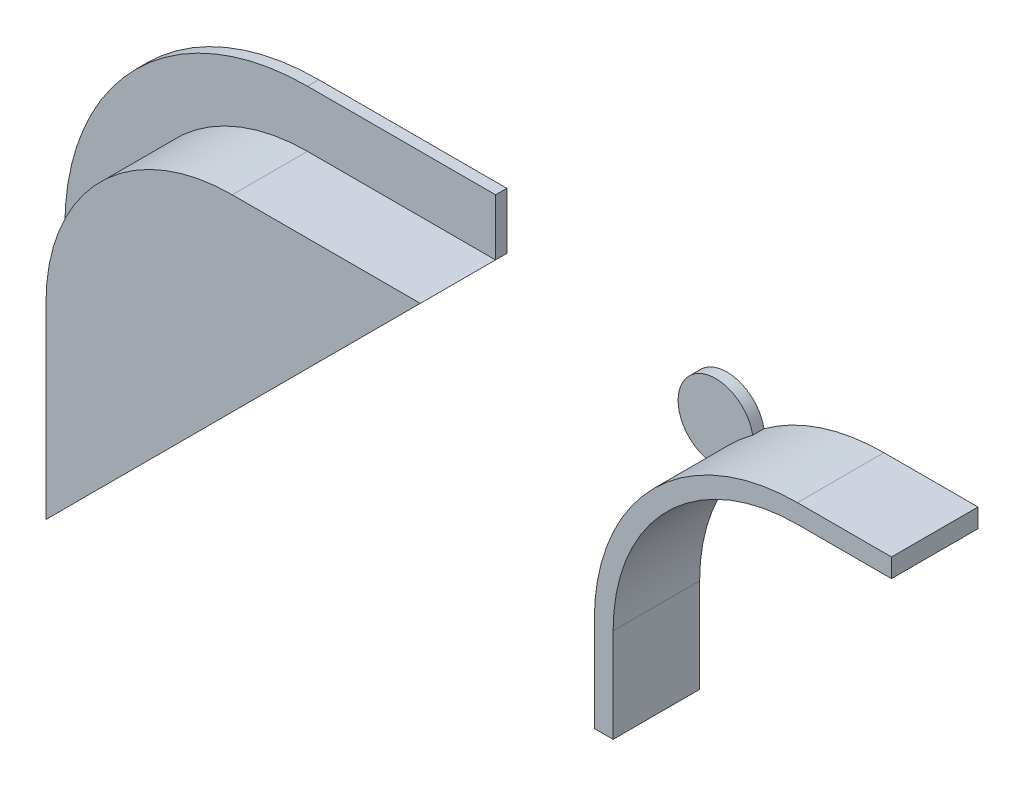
ISO-10303-21;
HEADER;
FILE_DESCRIPTION(('STEP AP214'),'2;1');
FILE_NAME('part.step','',(''),(''),'','','');
FILE_SCHEMA(('AUTOMOTIVE_DESIGN { 1 0 10303 214 1 1 1 1 }'));
ENDSEC;
DATA;
#1=APPLICATION_CONTEXT('core data for automotive mechanical design processes');
#2=APPLICATION_PROTOCOL_DEFINITION('international standard','automotive_design',2000,#1);
#3=PRODUCT_CONTEXT('',#1,'mechanical');
#4=PRODUCT('Part','Part','',(#3));
#5=PRODUCT_RELATED_PRODUCT_CATEGORY('part','',(#4));
#6=PRODUCT_DEFINITION_FORMATION('','',#4);
#7=PRODUCT_DEFINITION_CONTEXT('part definition',#1,'design');
#8=PRODUCT_DEFINITION('design','',#6,#7);
#9=PRODUCT_DEFINITION_SHAPE('','',#8);
#10=(LENGTH_UNIT() NAMED_UNIT(*) SI_UNIT(.MILLI.,.METRE.));
#11=(NAMED_UNIT(*) PLANE_ANGLE_UNIT() SI_UNIT($,.RADIAN.));
#12=(NAMED_UNIT(*) SI_UNIT($,.STERADIAN.) SOLID_ANGLE_UNIT());
#13=UNCERTAINTY_MEASURE_WITH_UNIT(LENGTH_MEASURE(1.E-05),#10,'distance_accuracy_value','');
#14=(GEOMETRIC_REPRESENTATION_CONTEXT(3) GLOBAL_UNCERTAINTY_ASSIGNED_CONTEXT((#13)) GLOBAL_UNIT_ASSIGNED_CONTEXT((#10,
#11,#12)) REPRESENTATION_CONTEXT('',''));
#15=CARTESIAN_POINT('',(0.,0.,0.));
#16=DIRECTION('',(0.,0.,1.));
#17=DIRECTION('',(1.,0.,0.));
#18=AXIS2_PLACEMENT_3D('',#15,#16,#17);
#19=CARTESIAN_POINT('',(20.2,0.,4.));
#20=DIRECTION('',(-1.,0.,0.));
#21=DIRECTION('',(0.,0.,1.));
#22=AXIS2_PLACEMENT_3D('',#19,#20,#21);
#23=PLANE('',#22);
#24=DIRECTION('',(0.,0.,-1.));
#25=VECTOR('',#24,1.);
#26=CARTESIAN_POINT('',(20.2,-5.,4.));
#27=LINE('',#26,#25);
#28=CARTESIAN_POINT('',(20.2,-5.,4.));
#29=VERTEX_POINT('',#28);
#30=CARTESIAN_POINT('',(20.2,-5.,-0.6));
#31=VERTEX_POINT('',#30);
#32=EDGE_CURVE('E136',#29,#31,#27,.T.);
#33=ORIENTED_EDGE('',*,*,#32,.T.);
#34=DIRECTION('',(0.,-1.,0.));
#35=VECTOR('',#34,1.);
#36=CARTESIAN_POINT('',(20.2,0.,-0.6));
#37=LINE('',#36,#35);
#38=CARTESIAN_POINT('',(20.2,0.,-0.6));
#39=VERTEX_POINT('',#38);
#40=EDGE_CURVE('E135',#39,#31,#37,.T.);
#41=ORIENTED_EDGE('',*,*,#40,.F.);
#42=DIRECTION('',(0.,0.,-1.));
#43=VECTOR('',#42,1.);
#44=CARTESIAN_POINT('',(20.2,0.,4.));
#45=LINE('',#44,#43);
#46=CARTESIAN_POINT('',(20.2,0.,4.));
#47=VERTEX_POINT('',#46);
#48=EDGE_CURVE('E12',#47,#39,#45,.T.);
#49=ORIENTED_EDGE('',*,*,#48,.F.);
#50=DIRECTION('',(0.,1.,0.));
#51=VECTOR('',#50,1.);
#52=CARTESIAN_POINT('',(20.2,0.,4.));
#53=LINE('',#52,#51);
#54=EDGE_CURVE('E175',#29,#47,#53,.T.);
#55=ORIENTED_EDGE('',*,*,#54,.F.);
#56=EDGE_LOOP('',(#33,#41,#49,#55));
#57=FACE_BOUND('',#56,.T.);
#58=ADVANCED_FACE('F51',(#57),#23,.F.);
#59=CARTESIAN_POINT('',(30.,0.,4.));
#60=DIRECTION('',(0.,0.,-1.));
#61=DIRECTION('',(-1.,0.,0.));
#62=AXIS2_PLACEMENT_3D('',#59,#60,#61);
#63=CYLINDRICAL_SURFACE('',#62,9.8);
#64=ORIENTED_EDGE('',*,*,#48,.T.);
#65=CARTESIAN_POINT('',(30.,0.,-0.6));
#66=DIRECTION('',(0.,0.,1.));
#67=DIRECTION('',(-1.,0.,0.));
#68=AXIS2_PLACEMENT_3D('',#65,#66,#67);
#69=CIRCLE('',#68,9.8);
#70=CARTESIAN_POINT('',(30.,9.8,-0.6));
#71=VERTEX_POINT('',#70);
#72=EDGE_CURVE('E130',#71,#39,#69,.T.);
#73=ORIENTED_EDGE('',*,*,#72,.F.);
#74=DIRECTION('',(0.,0.,-1.));
#75=VECTOR('',#74,1.);
#76=CARTESIAN_POINT('',(30.,9.8,4.));
#77=LINE('',#76,#75);
#78=CARTESIAN_POINT('',(30.,9.8,4.));
#79=VERTEX_POINT('',#78);
#80=EDGE_CURVE('E58',#79,#71,#77,.T.);
#81=ORIENTED_EDGE('',*,*,#80,.F.);
#82=CARTESIAN_POINT('',(30.,0.,4.));
#83=DIRECTION('',(0.,0.,-1.));
#84=DIRECTION('',(1.,0.,0.));
#85=AXIS2_PLACEMENT_3D('',#82,#83,#84);
#86=CIRCLE('',#85,9.8);
#87=EDGE_CURVE('E131',#47,#79,#86,.T.);
#88=ORIENTED_EDGE('',*,*,#87,.F.);
#89=EDGE_LOOP('',(#64,#73,#81,#88));
#90=FACE_BOUND('',#89,.T.);
#91=ADVANCED_FACE('F127',(#90),#63,.F.);
#92=CARTESIAN_POINT('',(30.,9.8,4.));
#93=DIRECTION('',(0.,1.,0.));
#94=DIRECTION('',(0.,0.,1.));
#95=AXIS2_PLACEMENT_3D('',#92,#93,#94);
#96=PLANE('',#95);
#97=ORIENTED_EDGE('',*,*,#80,.T.);
#98=DIRECTION('',(-1.,0.,0.));
#99=VECTOR('',#98,1.);
#100=CARTESIAN_POINT('',(35.,9.8,-0.6));
#101=LINE('',#100,#99);
#102=CARTESIAN_POINT('',(35.,9.8,-0.6));
#103=VERTEX_POINT('',#102);
#104=EDGE_CURVE('E146',#103,#71,#101,.T.);
#105=ORIENTED_EDGE('',*,*,#104,.F.);
#106=DIRECTION('',(0.,0.,-1.));
#107=VECTOR('',#106,1.);
#108=CARTESIAN_POINT('',(35.,9.8,4.));
#109=LINE('',#108,#107);
#110=CARTESIAN_POINT('',(35.,9.8,4.));
#111=VERTEX_POINT('',#110);
#112=EDGE_CURVE('E199',#111,#103,#109,.T.);
#113=ORIENTED_EDGE('',*,*,#112,.F.);
#114=DIRECTION('',(1.,0.,0.));
#115=VECTOR('',#114,1.);
#116=CARTESIAN_POINT('',(30.,9.8,4.));
#117=LINE('',#116,#115);
#118=EDGE_CURVE('E178',#79,#111,#117,.T.);
#119=ORIENTED_EDGE('',*,*,#118,.F.);
#120=EDGE_LOOP('',(#97,#105,#113,#119));
#121=FACE_BOUND('',#120,.T.);
#122=ADVANCED_FACE('F202',(#121),#96,.F.);
#123=CARTESIAN_POINT('',(35.,9.8,4.));
#124=DIRECTION('',(-1.,0.,0.));
#125=DIRECTION('',(0.,0.,1.));
#126=AXIS2_PLACEMENT_3D('',#123,#124,#125);
#127=PLANE('',#126);
#128=ORIENTED_EDGE('',*,*,#112,.T.);
#129=DIRECTION('',(0.,-1.,0.));
#130=VECTOR('',#129,1.);
#131=CARTESIAN_POINT('',(35.,10.8,-0.6));
#132=LINE('',#131,#130);
#133=CARTESIAN_POINT('',(35.,10.8,-0.6));
#134=VERTEX_POINT('',#133);
#135=EDGE_CURVE('E166',#134,#103,#132,.T.);
#136=ORIENTED_EDGE('',*,*,#135,.F.);
#137=DIRECTION('',(0.,0.,-1.));
#138=VECTOR('',#137,1.);
#139=CARTESIAN_POINT('',(35.,10.8,4.));
#140=LINE('',#139,#138);
#141=CARTESIAN_POINT('',(35.,10.8,4.));
#142=VERTEX_POINT('',#141);
#143=EDGE_CURVE('E197',#142,#134,#140,.T.);
#144=ORIENTED_EDGE('',*,*,#143,.F.);
#145=DIRECTION('',(0.,1.,0.));
#146=VECTOR('',#145,1.);
#147=CARTESIAN_POINT('',(35.,9.8,4.));
#148=LINE('',#147,#146);
#149=EDGE_CURVE('E180',#111,#142,#148,.T.);
#150=ORIENTED_EDGE('',*,*,#149,.F.);
#151=EDGE_LOOP('',(#128,#136,#144,#150));
#152=FACE_BOUND('',#151,.T.);
#153=ADVANCED_FACE('F211',(#152),#127,.F.);
#154=CARTESIAN_POINT('',(30.,10.8,4.));
#155=DIRECTION('',(0.,-1.,0.));
#156=DIRECTION('',(0.,0.,-1.));
#157=AXIS2_PLACEMENT_3D('',#154,#155,#156);
#158=PLANE('',#157);
#159=ORIENTED_EDGE('',*,*,#143,.T.);
#160=DIRECTION('',(1.,0.,0.));
#161=VECTOR('',#160,1.);
#162=CARTESIAN_POINT('',(30.,10.8,-0.6));
#163=LINE('',#162,#161);
#164=CARTESIAN_POINT('',(30.,10.8,-0.6));
#165=VERTEX_POINT('',#164);
#166=EDGE_CURVE('E163',#165,#134,#163,.T.);
#167=ORIENTED_EDGE('',*,*,#166,.F.);
#168=DIRECTION('',(0.,0.,-1.));
#169=VECTOR('',#168,1.);
#170=CARTESIAN_POINT('',(30.,10.8,4.));
#171=LINE('',#170,#169);
#172=CARTESIAN_POINT('',(30.,10.8,4.));
#173=VERTEX_POINT('',#172);
#174=EDGE_CURVE('E195',#173,#165,#171,.T.);
#175=ORIENTED_EDGE('',*,*,#174,.F.);
#176=DIRECTION('',(-1.,0.,0.));
#177=VECTOR('',#176,1.);
#178=CARTESIAN_POINT('',(30.,10.8,4.));
#179=LINE('',#178,#177);
#180=EDGE_CURVE('E182',#142,#173,#179,.T.);
#181=ORIENTED_EDGE('',*,*,#180,.F.);
#182=EDGE_LOOP('',(#159,#167,#175,#181));
#183=FACE_BOUND('',#182,.T.);
#184=ADVANCED_FACE('F214',(#183),#158,.F.);
#185=CARTESIAN_POINT('',(30.,0.,4.));
#186=DIRECTION('',(0.,0.,-1.));
#187=DIRECTION('',(-1.,0.,0.));
#188=AXIS2_PLACEMENT_3D('',#185,#186,#187);
#189=CYLINDRICAL_SURFACE('',#188,10.8);
#190=ORIENTED_EDGE('',*,*,#174,.T.);
#191=CARTESIAN_POINT('',(30.,0.,-0.6));
#192=DIRECTION('',(0.,0.,-1.));
#193=DIRECTION('',(-1.,0.,0.));
#194=AXIS2_PLACEMENT_3D('',#191,#192,#193);
#195=CIRCLE('',#194,10.8);
#196=CARTESIAN_POINT('',(23.6213805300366,8.71511409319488,-0.6));
#197=VERTEX_POINT('',#196);
#198=EDGE_CURVE('E160',#197,#165,#195,.T.);
#199=ORIENTED_EDGE('',*,*,#198,.F.);
#200=DIRECTION('',(0.,0.,1.));
#201=VECTOR('',#200,1.);
#202=CARTESIAN_POINT('',(23.6213805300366,8.71511409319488,-0.6));
#203=LINE('',#202,#201);
#204=CARTESIAN_POINT('',(23.6213805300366,8.71511409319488,0.));
#205=VERTEX_POINT('',#204);
#206=EDGE_CURVE('E168',#197,#205,#203,.T.);
#207=ORIENTED_EDGE('',*,*,#206,.T.);
#208=CARTESIAN_POINT('',(30.,0.,0.));
#209=DIRECTION('',(0.,0.,1.));
#210=DIRECTION('',(1.,0.,0.));
#211=AXIS2_PLACEMENT_3D('',#208,#209,#210);
#212=CIRCLE('',#211,10.8);
#213=CARTESIAN_POINT('',(21.2848859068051,6.3786194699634,0.));
#214=VERTEX_POINT('',#213);
#215=EDGE_CURVE('E174',#205,#214,#212,.T.);
#216=ORIENTED_EDGE('',*,*,#215,.T.);
#217=DIRECTION('',(0.,0.,1.));
#218=VECTOR('',#217,1.);
#219=CARTESIAN_POINT('',(21.2848859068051,6.3786194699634,-0.6));
#220=LINE('',#219,#218);
#221=CARTESIAN_POINT('',(21.2848859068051,6.3786194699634,-0.6));
#222=VERTEX_POINT('',#221);
#223=EDGE_CURVE('E172',#222,#214,#220,.T.);
#224=ORIENTED_EDGE('',*,*,#223,.F.);
#225=CARTESIAN_POINT('',(30.,0.,-0.6));
#226=DIRECTION('',(0.,0.,-1.));
#227=DIRECTION('',(-1.,0.,0.));
#228=AXIS2_PLACEMENT_3D('',#225,#226,#227);
#229=CIRCLE('',#228,10.8);
#230=CARTESIAN_POINT('',(19.2,0.,-0.6));
#231=VERTEX_POINT('',#230);
#232=EDGE_CURVE('E156',#231,#222,#229,.T.);
#233=ORIENTED_EDGE('',*,*,#232,.F.);
#234=DIRECTION('',(0.,0.,-1.));
#235=VECTOR('',#234,1.);
#236=CARTESIAN_POINT('',(19.2,0.,4.));
#237=LINE('',#236,#235);
#238=CARTESIAN_POINT('',(19.2,0.,4.));
#239=VERTEX_POINT('',#238);
#240=EDGE_CURVE('E193',#239,#231,#237,.T.);
#241=ORIENTED_EDGE('',*,*,#240,.F.);
#242=CARTESIAN_POINT('',(30.,0.,4.));
#243=DIRECTION('',(0.,0.,1.));
#244=DIRECTION('',(1.,0.,0.));
#245=AXIS2_PLACEMENT_3D('',#242,#243,#244);
#246=CIRCLE('',#245,10.8);
#247=EDGE_CURVE('E184',#173,#239,#246,.T.);
#248=ORIENTED_EDGE('',*,*,#247,.F.);
#249=EDGE_LOOP('',(#190,#199,#207,#216,#224,#233,#241,#248));
#250=FACE_BOUND('',#249,.T.);
#251=ADVANCED_FACE('F219',(#250),#189,.T.);
#252=CARTESIAN_POINT('',(19.2,0.,4.));
#253=DIRECTION('',(1.,0.,0.));
#254=DIRECTION('',(0.,0.,-1.));
#255=AXIS2_PLACEMENT_3D('',#252,#253,#254);
#256=PLANE('',#255);
#257=ORIENTED_EDGE('',*,*,#240,.T.);
#258=DIRECTION('',(0.,1.,0.));
#259=VECTOR('',#258,1.);
#260=CARTESIAN_POINT('',(19.2,-5.,-0.6));
#261=LINE('',#260,#259);
#262=CARTESIAN_POINT('',(19.2,-5.,-0.6));
#263=VERTEX_POINT('',#262);
#264=EDGE_CURVE('E153',#263,#231,#261,.T.);
#265=ORIENTED_EDGE('',*,*,#264,.F.);
#266=DIRECTION('',(0.,0.,-1.));
#267=VECTOR('',#266,1.);
#268=CARTESIAN_POINT('',(19.2,-5.,4.));
#269=LINE('',#268,#267);
#270=CARTESIAN_POINT('',(19.2,-5.,4.));
#271=VERTEX_POINT('',#270);
#272=EDGE_CURVE('E191',#271,#263,#269,.T.);
#273=ORIENTED_EDGE('',*,*,#272,.F.);
#274=DIRECTION('',(0.,-1.,0.));
#275=VECTOR('',#274,1.);
#276=CARTESIAN_POINT('',(19.2,0.,4.));
#277=LINE('',#276,#275);
#278=EDGE_CURVE('E70',#239,#271,#277,.T.);
#279=ORIENTED_EDGE('',*,*,#278,.F.);
#280=EDGE_LOOP('',(#257,#265,#273,#279));
#281=FACE_BOUND('',#280,.T.);
#282=ADVANCED_FACE('F224',(#281),#256,.F.);
#283=CARTESIAN_POINT('',(19.2,-5.,4.));
#284=DIRECTION('',(0.,1.,0.));
#285=DIRECTION('',(0.,0.,1.));
#286=AXIS2_PLACEMENT_3D('',#283,#284,#285);
#287=PLANE('',#286);
#288=ORIENTED_EDGE('',*,*,#272,.T.);
#289=DIRECTION('',(-1.,0.,0.));
#290=VECTOR('',#289,1.);
#291=CARTESIAN_POINT('',(20.2,-5.,-0.6));
#292=LINE('',#291,#290);
#293=EDGE_CURVE('E140',#31,#263,#292,.T.);
#294=ORIENTED_EDGE('',*,*,#293,.F.);
#295=ORIENTED_EDGE('',*,*,#32,.F.);
#296=DIRECTION('',(1.,0.,0.));
#297=VECTOR('',#296,1.);
#298=CARTESIAN_POINT('',(19.2,-5.,4.));
#299=LINE('',#298,#297);
#300=EDGE_CURVE('E65',#271,#29,#299,.T.);
#301=ORIENTED_EDGE('',*,*,#300,.F.);
#302=EDGE_LOOP('',(#288,#294,#295,#301));
#303=FACE_BOUND('',#302,.T.);
#304=ADVANCED_FACE('F226',(#303),#287,.F.);
#305=CARTESIAN_POINT('',(30.,0.,4.));
#306=DIRECTION('',(0.,0.,1.));
#307=DIRECTION('',(1.,0.,0.));
#308=AXIS2_PLACEMENT_3D('',#305,#306,#307);
#309=PLANE('',#308);
#310=ORIENTED_EDGE('',*,*,#54,.T.);
#311=ORIENTED_EDGE('',*,*,#87,.T.);
#312=ORIENTED_EDGE('',*,*,#118,.T.);
#313=ORIENTED_EDGE('',*,*,#149,.T.);
#314=ORIENTED_EDGE('',*,*,#180,.T.);
#315=ORIENTED_EDGE('',*,*,#247,.T.);
#316=ORIENTED_EDGE('',*,*,#278,.T.);
#317=ORIENTED_EDGE('',*,*,#300,.T.);
#318=EDGE_LOOP('',(#310,#311,#312,#313,#314,#315,#316,#317));
#319=FACE_BOUND('',#318,.T.);
#320=ADVANCED_FACE('F205',(#319),#309,.T.);
#321=CARTESIAN_POINT('',(30.,0.,0.));
#322=DIRECTION('',(0.,0.,-1.));
#323=DIRECTION('',(-1.,0.,0.));
#324=AXIS2_PLACEMENT_3D('',#321,#322,#323);
#325=PLANE('',#324);
#326=ORIENTED_EDGE('',*,*,#215,.F.);
#327=CARTESIAN_POINT('',(21.6561399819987,8.34386001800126,0.));
#328=DIRECTION('',(0.,0.,-1.));
#329=DIRECTION('',(-1.,0.,0.));
#330=AXIS2_PLACEMENT_3D('',#327,#328,#329);
#331=CIRCLE('',#330,2.00000000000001);
#332=EDGE_CURVE('E147',#214,#205,#331,.T.);
#333=ORIENTED_EDGE('',*,*,#332,.F.);
#334=EDGE_LOOP('',(#326,#333));
#335=FACE_BOUND('',#334,.T.);
#336=ADVANCED_FACE('F233',(#335),#325,.F.);
#337=CARTESIAN_POINT('',(21.6561399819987,8.34386001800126,-0.6));
#338=DIRECTION('',(0.,0.,1.));
#339=DIRECTION('',(1.,0.,0.));
#340=AXIS2_PLACEMENT_3D('',#337,#338,#339);
#341=CYLINDRICAL_SURFACE('',#340,2.00000000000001);
#342=ORIENTED_EDGE('',*,*,#332,.T.);
#343=ORIENTED_EDGE('',*,*,#206,.F.);
#344=CARTESIAN_POINT('',(21.6561399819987,8.34386001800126,-0.6));
#345=DIRECTION('',(0.,0.,-1.));
#346=DIRECTION('',(-1.,0.,0.));
#347=AXIS2_PLACEMENT_3D('',#344,#345,#346);
#348=CIRCLE('',#347,2.00000000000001);
#349=EDGE_CURVE('E158',#222,#197,#348,.T.);
#350=ORIENTED_EDGE('',*,*,#349,.F.);
#351=ORIENTED_EDGE('',*,*,#223,.T.);
#352=EDGE_LOOP('',(#342,#343,#350,#351));
#353=FACE_BOUND('',#352,.T.);
#354=ADVANCED_FACE('F231',(#353),#341,.T.);
#355=CARTESIAN_POINT('',(30.,0.,-0.6));
#356=DIRECTION('',(0.,0.,-1.));
#357=DIRECTION('',(-1.,0.,0.));
#358=AXIS2_PLACEMENT_3D('',#355,#356,#357);
#359=PLANE('',#358);
#360=ORIENTED_EDGE('',*,*,#72,.T.);
#361=ORIENTED_EDGE('',*,*,#40,.T.);
#362=ORIENTED_EDGE('',*,*,#293,.T.);
#363=ORIENTED_EDGE('',*,*,#264,.T.);
#364=ORIENTED_EDGE('',*,*,#232,.T.);
#365=ORIENTED_EDGE('',*,*,#349,.T.);
#366=ORIENTED_EDGE('',*,*,#198,.T.);
#367=ORIENTED_EDGE('',*,*,#166,.T.);
#368=ORIENTED_EDGE('',*,*,#135,.T.);
#369=ORIENTED_EDGE('',*,*,#104,.T.);
#370=EDGE_LOOP('',(#360,#361,#362,#363,#364,#365,#366,#367,#368,#369));
#371=FACE_BOUND('',#370,.T.);
#372=ADVANCED_FACE('F143',(#371),#359,.T.);
#373=CLOSED_SHELL('',(#58,#91,#122,#153,#184,#251,#282,#304,#320,#336,#354,#372));
#374=MANIFOLD_SOLID_BREP('B2',#373);
#375=CARTESIAN_POINT('',(-9.94999999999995,-9.94999999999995,4.));
#376=DIRECTION('',(-0.707106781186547,0.707106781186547,0.));
#377=DIRECTION('',(-0.707106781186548,-0.707106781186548,0.));
#378=AXIS2_PLACEMENT_3D('',#375,#376,#377);
#379=PLANE('',#378);
#380=DIRECTION('',(0.,0.,-1.));
#381=VECTOR('',#380,1.);
#382=CARTESIAN_POINT('',(-9.94999999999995,-9.94999999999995,4.));
#383=LINE('',#382,#381);
#384=CARTESIAN_POINT('',(-9.94999999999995,-9.94999999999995,4.));
#385=VERTEX_POINT('',#384);
#386=CARTESIAN_POINT('',(-9.94999999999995,-9.94999999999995,0.));
#387=VERTEX_POINT('',#386);
#388=EDGE_CURVE('E448',#385,#387,#383,.T.);
#389=ORIENTED_EDGE('',*,*,#388,.T.);
#390=DIRECTION('',(0.,0.,1.));
#391=VECTOR('',#390,1.);
#392=CARTESIAN_POINT('',(-9.94999999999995,-9.94999999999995,-0.6));
#393=LINE('',#392,#391);
#394=CARTESIAN_POINT('',(-9.94999999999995,-9.94999999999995,-0.6));
#395=VERTEX_POINT('',#394);
#396=EDGE_CURVE('E428',#395,#387,#393,.T.);
#397=ORIENTED_EDGE('',*,*,#396,.F.);
#398=DIRECTION('',(-0.707106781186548,-0.707106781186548,0.));
#399=VECTOR('',#398,1.);
#400=CARTESIAN_POINT('',(9.95000000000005,9.95000000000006,-0.6));
#401=LINE('',#400,#399);
#402=CARTESIAN_POINT('',(9.95000000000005,9.95000000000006,-0.6));
#403=VERTEX_POINT('',#402);
#404=EDGE_CURVE('E435',#403,#395,#401,.T.);
#405=ORIENTED_EDGE('',*,*,#404,.F.);
#406=DIRECTION('',(0.,0.,1.));
#407=VECTOR('',#406,1.);
#408=CARTESIAN_POINT('',(9.95000000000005,9.95000000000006,-0.6));
#409=LINE('',#408,#407);
#410=CARTESIAN_POINT('',(9.95000000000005,9.95000000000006,0.));
#411=VERTEX_POINT('',#410);
#412=EDGE_CURVE('E490',#403,#411,#409,.T.);
#413=ORIENTED_EDGE('',*,*,#412,.T.);
#414=DIRECTION('',(0.,0.,-1.));
#415=VECTOR('',#414,1.);
#416=CARTESIAN_POINT('',(9.95000000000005,9.95000000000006,4.));
#417=LINE('',#416,#415);
#418=CARTESIAN_POINT('',(9.95000000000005,9.95000000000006,4.));
#419=VERTEX_POINT('',#418);
#420=EDGE_CURVE('E49',#419,#411,#417,.T.);
#421=ORIENTED_EDGE('',*,*,#420,.F.);
#422=DIRECTION('',(0.707106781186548,0.707106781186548,0.));
#423=VECTOR('',#422,1.);
#424=CARTESIAN_POINT('',(-9.94999999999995,-9.94999999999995,4.));
#425=LINE('',#424,#423);
#426=EDGE_CURVE('E458',#385,#419,#425,.T.);
#427=ORIENTED_EDGE('',*,*,#426,.F.);
#428=EDGE_LOOP('',(#389,#397,#405,#413,#421,#427));
#429=FACE_BOUND('',#428,.T.);
#430=ADVANCED_FACE('F358',(#429),#379,.F.);
#431=CARTESIAN_POINT('',(-0.0499999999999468,9.95000000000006,4.));
#432=DIRECTION('',(0.,-1.,0.));
#433=DIRECTION('',(0.,0.,-1.));
#434=AXIS2_PLACEMENT_3D('',#431,#432,#433);
#435=PLANE('',#434);
#436=DIRECTION('',(-1.,0.,0.));
#437=VECTOR('',#436,1.);
#438=CARTESIAN_POINT('',(-0.0499999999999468,9.95000000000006,0.));
#439=LINE('',#438,#437);
#440=CARTESIAN_POINT('',(-0.0499999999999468,9.95000000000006,0.));
#441=VERTEX_POINT('',#440);
#442=EDGE_CURVE('E449',#411,#441,#439,.T.);
#443=ORIENTED_EDGE('',*,*,#442,.T.);
#444=DIRECTION('',(0.,0.,-1.));
#445=VECTOR('',#444,1.);
#446=CARTESIAN_POINT('',(-0.0499999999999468,9.95000000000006,4.));
#447=LINE('',#446,#445);
#448=CARTESIAN_POINT('',(-0.0499999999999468,9.95000000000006,4.));
#449=VERTEX_POINT('',#448);
#450=EDGE_CURVE('E366',#449,#441,#447,.T.);
#451=ORIENTED_EDGE('',*,*,#450,.F.);
#452=DIRECTION('',(-1.,0.,0.));
#453=VECTOR('',#452,1.);
#454=CARTESIAN_POINT('',(-0.0499999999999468,9.95000000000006,4.));
#455=LINE('',#454,#453);
#456=EDGE_CURVE('E460',#419,#449,#455,.T.);
#457=ORIENTED_EDGE('',*,*,#456,.F.);
#458=ORIENTED_EDGE('',*,*,#420,.T.);
#459=EDGE_LOOP('',(#443,#451,#457,#458));
#460=FACE_BOUND('',#459,.T.);
#461=ADVANCED_FACE('F480',(#460),#435,.F.);
#462=CARTESIAN_POINT('',(-0.0499999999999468,0.0500000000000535,4.));
#463=DIRECTION('',(0.,0.,-1.));
#464=DIRECTION('',(-1.,0.,0.));
#465=AXIS2_PLACEMENT_3D('',#462,#463,#464);
#466=CYLINDRICAL_SURFACE('',#465,9.9);
#467=CARTESIAN_POINT('',(-0.0499999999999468,0.0500000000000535,0.));
#468=DIRECTION('',(0.,0.,1.));
#469=DIRECTION('',(-1.,0.,0.));
#470=AXIS2_PLACEMENT_3D('',#467,#468,#469);
#471=CIRCLE('',#470,9.9);
#472=CARTESIAN_POINT('',(-9.94999999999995,0.0500000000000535,0.));
#473=VERTEX_POINT('',#472);
#474=EDGE_CURVE('E452',#441,#473,#471,.T.);
#475=ORIENTED_EDGE('',*,*,#474,.T.);
#476=DIRECTION('',(0.,0.,-1.));
#477=VECTOR('',#476,1.);
#478=CARTESIAN_POINT('',(-9.94999999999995,0.0500000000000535,4.));
#479=LINE('',#478,#477);
#480=CARTESIAN_POINT('',(-9.94999999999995,0.0500000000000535,4.));
#481=VERTEX_POINT('',#480);
#482=EDGE_CURVE('E470',#481,#473,#479,.T.);
#483=ORIENTED_EDGE('',*,*,#482,.F.);
#484=CARTESIAN_POINT('',(-0.0499999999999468,0.0500000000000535,4.));
#485=DIRECTION('',(0.,0.,1.));
#486=DIRECTION('',(-1.,0.,0.));
#487=AXIS2_PLACEMENT_3D('',#484,#485,#486);
#488=CIRCLE('',#487,9.9);
#489=EDGE_CURVE('E463',#449,#481,#488,.T.);
#490=ORIENTED_EDGE('',*,*,#489,.F.);
#491=ORIENTED_EDGE('',*,*,#450,.T.);
#492=EDGE_LOOP('',(#475,#483,#490,#491));
#493=FACE_BOUND('',#492,.T.);
#494=ADVANCED_FACE('F476',(#493),#466,.T.);
#495=CARTESIAN_POINT('',(-9.94999999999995,-9.94999999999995,4.));
#496=DIRECTION('',(1.,0.,0.));
#497=DIRECTION('',(0.,0.,-1.));
#498=AXIS2_PLACEMENT_3D('',#495,#496,#497);
#499=PLANE('',#498);
#500=DIRECTION('',(0.,-1.,0.));
#501=VECTOR('',#500,1.);
#502=CARTESIAN_POINT('',(-9.94999999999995,-9.94999999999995,0.));
#503=LINE('',#502,#501);
#504=EDGE_CURVE('E461',#473,#387,#503,.T.);
#505=ORIENTED_EDGE('',*,*,#504,.T.);
#506=ORIENTED_EDGE('',*,*,#388,.F.);
#507=DIRECTION('',(0.,-1.,0.));
#508=VECTOR('',#507,1.);
#509=CARTESIAN_POINT('',(-9.94999999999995,-9.94999999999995,4.));
#510=LINE('',#509,#508);
#511=EDGE_CURVE('E373',#481,#385,#510,.T.);
#512=ORIENTED_EDGE('',*,*,#511,.F.);
#513=ORIENTED_EDGE('',*,*,#482,.T.);
#514=EDGE_LOOP('',(#505,#506,#512,#513));
#515=FACE_BOUND('',#514,.T.);
#516=ADVANCED_FACE('F541',(#515),#499,.F.);
#517=CARTESIAN_POINT('',(-0.0499999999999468,0.0500000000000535,4.));
#518=DIRECTION('',(0.,0.,-1.));
#519=DIRECTION('',(-1.,0.,0.));
#520=AXIS2_PLACEMENT_3D('',#517,#518,#519);
#521=PLANE('',#520);
#522=ORIENTED_EDGE('',*,*,#426,.T.);
#523=ORIENTED_EDGE('',*,*,#456,.T.);
#524=ORIENTED_EDGE('',*,*,#489,.T.);
#525=ORIENTED_EDGE('',*,*,#511,.T.);
#526=EDGE_LOOP('',(#522,#523,#524,#525));
#527=FACE_BOUND('',#526,.T.);
#528=ADVANCED_FACE('F531',(#527),#521,.F.);
#529=CARTESIAN_POINT('',(-9.94999999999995,-9.94999999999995,-0.6));
#530=DIRECTION('',(0.,1.,0.));
#531=DIRECTION('',(0.,0.,1.));
#532=AXIS2_PLACEMENT_3D('',#529,#530,#531);
#533=PLANE('',#532);
#534=DIRECTION('',(-1.,0.,0.));
#535=VECTOR('',#534,1.);
#536=CARTESIAN_POINT('',(-9.94999999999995,-9.94999999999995,0.));
#537=LINE('',#536,#535);
#538=CARTESIAN_POINT('',(-12.9499999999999,-9.94999999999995,0.));
#539=VERTEX_POINT('',#538);
#540=EDGE_CURVE('E516',#387,#539,#537,.T.);
#541=ORIENTED_EDGE('',*,*,#540,.T.);
#542=DIRECTION('',(0.,0.,1.));
#543=VECTOR('',#542,1.);
#544=CARTESIAN_POINT('',(-12.9499999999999,-9.94999999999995,-0.6));
#545=LINE('',#544,#543);
#546=CARTESIAN_POINT('',(-12.9499999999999,-9.94999999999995,-0.6));
#547=VERTEX_POINT('',#546);
#548=EDGE_CURVE('E431',#547,#539,#545,.T.);
#549=ORIENTED_EDGE('',*,*,#548,.F.);
#550=DIRECTION('',(-1.,0.,0.));
#551=VECTOR('',#550,1.);
#552=CARTESIAN_POINT('',(-9.94999999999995,-9.94999999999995,-0.6));
#553=LINE('',#552,#551);
#554=EDGE_CURVE('E424',#395,#547,#553,.T.);
#555=ORIENTED_EDGE('',*,*,#554,.F.);
#556=ORIENTED_EDGE('',*,*,#396,.T.);
#557=EDGE_LOOP('',(#541,#549,#555,#556));
#558=FACE_BOUND('',#557,.T.);
#559=ADVANCED_FACE('F426',(#558),#533,.F.);
#560=CARTESIAN_POINT('',(-12.9499999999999,0.0500000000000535,-0.6));
#561=DIRECTION('',(1.,0.,0.));
#562=DIRECTION('',(0.,0.,-1.));
#563=AXIS2_PLACEMENT_3D('',#560,#561,#562);
#564=PLANE('',#563);
#565=DIRECTION('',(0.,1.,0.));
#566=VECTOR('',#565,1.);
#567=CARTESIAN_POINT('',(-12.9499999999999,0.0500000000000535,0.));
#568=LINE('',#567,#566);
#569=CARTESIAN_POINT('',(-12.9499999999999,0.0500000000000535,0.));
#570=VERTEX_POINT('',#569);
#571=EDGE_CURVE('E514',#539,#570,#568,.T.);
#572=ORIENTED_EDGE('',*,*,#571,.T.);
#573=DIRECTION('',(0.,0.,1.));
#574=VECTOR('',#573,1.);
#575=CARTESIAN_POINT('',(-12.9499999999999,0.0500000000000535,-0.6));
#576=LINE('',#575,#574);
#577=CARTESIAN_POINT('',(-12.9499999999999,0.0500000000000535,-0.6));
#578=VERTEX_POINT('',#577);
#579=EDGE_CURVE('E454',#578,#570,#576,.T.);
#580=ORIENTED_EDGE('',*,*,#579,.F.);
#581=DIRECTION('',(0.,1.,0.));
#582=VECTOR('',#581,1.);
#583=CARTESIAN_POINT('',(-12.9499999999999,0.0500000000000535,-0.6));
#584=LINE('',#583,#582);
#585=EDGE_CURVE('E434',#547,#578,#584,.T.);
#586=ORIENTED_EDGE('',*,*,#585,.F.);
#587=ORIENTED_EDGE('',*,*,#548,.T.);
#588=EDGE_LOOP('',(#572,#580,#586,#587));
#589=FACE_BOUND('',#588,.T.);
#590=ADVANCED_FACE('F522',(#589),#564,.F.);
#591=CARTESIAN_POINT('',(-0.0499999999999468,0.0500000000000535,-0.6));
#592=DIRECTION('',(0.,0.,1.));
#593=DIRECTION('',(1.,0.,0.));
#594=AXIS2_PLACEMENT_3D('',#591,#592,#593);
#595=CYLINDRICAL_SURFACE('',#594,12.9);
#596=CARTESIAN_POINT('',(-0.0499999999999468,0.0500000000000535,0.));
#597=DIRECTION('',(0.,0.,-1.));
#598=DIRECTION('',(-1.,0.,0.));
#599=AXIS2_PLACEMENT_3D('',#596,#597,#598);
#600=CIRCLE('',#599,12.9);
#601=CARTESIAN_POINT('',(-0.0499999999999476,12.9500000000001,0.));
#602=VERTEX_POINT('',#601);
#603=EDGE_CURVE('E510',#570,#602,#600,.T.);
#604=ORIENTED_EDGE('',*,*,#603,.T.);
#605=DIRECTION('',(0.,0.,1.));
#606=VECTOR('',#605,1.);
#607=CARTESIAN_POINT('',(-0.0499999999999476,12.9500000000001,-0.6));
#608=LINE('',#607,#606);
#609=CARTESIAN_POINT('',(-0.0499999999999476,12.9500000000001,-0.6));
#610=VERTEX_POINT('',#609);
#611=EDGE_CURVE('E496',#610,#602,#608,.T.);
#612=ORIENTED_EDGE('',*,*,#611,.F.);
#613=CARTESIAN_POINT('',(-0.0499999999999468,0.0500000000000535,-0.6));
#614=DIRECTION('',(0.,0.,-1.));
#615=DIRECTION('',(-1.,0.,0.));
#616=AXIS2_PLACEMENT_3D('',#613,#614,#615);
#617=CIRCLE('',#616,12.9);
#618=EDGE_CURVE('E511',#578,#610,#617,.T.);
#619=ORIENTED_EDGE('',*,*,#618,.F.);
#620=ORIENTED_EDGE('',*,*,#579,.T.);
#621=EDGE_LOOP('',(#604,#612,#619,#620));
#622=FACE_BOUND('',#621,.T.);
#623=ADVANCED_FACE('F508',(#622),#595,.T.);
#624=CARTESIAN_POINT('',(9.95000000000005,12.9500000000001,-0.6));
#625=DIRECTION('',(0.,-1.,0.));
#626=DIRECTION('',(0.,0.,-1.));
#627=AXIS2_PLACEMENT_3D('',#624,#625,#626);
#628=PLANE('',#627);
#629=DIRECTION('',(1.,0.,0.));
#630=VECTOR('',#629,1.);
#631=CARTESIAN_POINT('',(9.95000000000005,12.9500000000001,0.));
#632=LINE('',#631,#630);
#633=CARTESIAN_POINT('',(9.95000000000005,12.9500000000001,0.));
#634=VERTEX_POINT('',#633);
#635=EDGE_CURVE('E493',#602,#634,#632,.T.);
#636=ORIENTED_EDGE('',*,*,#635,.T.);
#637=DIRECTION('',(0.,0.,1.));
#638=VECTOR('',#637,1.);
#639=CARTESIAN_POINT('',(9.95000000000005,12.9500000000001,-0.6));
#640=LINE('',#639,#638);
#641=CARTESIAN_POINT('',(9.95000000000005,12.9500000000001,-0.6));
#642=VERTEX_POINT('',#641);
#643=EDGE_CURVE('E492',#642,#634,#640,.T.);
#644=ORIENTED_EDGE('',*,*,#643,.F.);
#645=DIRECTION('',(1.,0.,0.));
#646=VECTOR('',#645,1.);
#647=CARTESIAN_POINT('',(9.95000000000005,12.9500000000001,-0.6));
#648=LINE('',#647,#646);
#649=EDGE_CURVE('E498',#610,#642,#648,.T.);
#650=ORIENTED_EDGE('',*,*,#649,.F.);
#651=ORIENTED_EDGE('',*,*,#611,.T.);
#652=EDGE_LOOP('',(#636,#644,#650,#651));
#653=FACE_BOUND('',#652,.T.);
#654=ADVANCED_FACE('F529',(#653),#628,.F.);
#655=CARTESIAN_POINT('',(9.95000000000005,12.9500000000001,-0.6));
#656=DIRECTION('',(-1.,0.,0.));
#657=DIRECTION('',(0.,0.,1.));
#658=AXIS2_PLACEMENT_3D('',#655,#656,#657);
#659=PLANE('',#658);
#660=DIRECTION('',(0.,-1.,0.));
#661=VECTOR('',#660,1.);
#662=CARTESIAN_POINT('',(9.95000000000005,12.9500000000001,0.));
#663=LINE('',#662,#661);
#664=EDGE_CURVE('E444',#634,#411,#663,.T.);
#665=ORIENTED_EDGE('',*,*,#664,.T.);
#666=ORIENTED_EDGE('',*,*,#412,.F.);
#667=DIRECTION('',(0.,-1.,0.));
#668=VECTOR('',#667,1.);
#669=CARTESIAN_POINT('',(9.95000000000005,12.9500000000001,-0.6));
#670=LINE('',#669,#668);
#671=EDGE_CURVE('E440',#642,#403,#670,.T.);
#672=ORIENTED_EDGE('',*,*,#671,.F.);
#673=ORIENTED_EDGE('',*,*,#643,.T.);
#674=EDGE_LOOP('',(#665,#666,#672,#673));
#675=FACE_BOUND('',#674,.T.);
#676=ADVANCED_FACE('F489',(#675),#659,.F.);
#677=CARTESIAN_POINT('',(-0.0499999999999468,0.0500000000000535,-0.6));
#678=DIRECTION('',(0.,0.,-1.));
#679=DIRECTION('',(-1.,0.,0.));
#680=AXIS2_PLACEMENT_3D('',#677,#678,#679);
#681=PLANE('',#680);
#682=ORIENTED_EDGE('',*,*,#404,.T.);
#683=ORIENTED_EDGE('',*,*,#554,.T.);
#684=ORIENTED_EDGE('',*,*,#585,.T.);
#685=ORIENTED_EDGE('',*,*,#618,.T.);
#686=ORIENTED_EDGE('',*,*,#649,.T.);
#687=ORIENTED_EDGE('',*,*,#671,.T.);
#688=EDGE_LOOP('',(#682,#683,#684,#685,#686,#687));
#689=FACE_BOUND('',#688,.T.);
#690=ADVANCED_FACE('F438',(#689),#681,.T.);
#691=CARTESIAN_POINT('',(-0.0499999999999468,0.0500000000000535,0.));
#692=DIRECTION('',(0.,0.,-1.));
#693=DIRECTION('',(-1.,0.,0.));
#694=AXIS2_PLACEMENT_3D('',#691,#692,#693);
#695=PLANE('',#694);
#696=ORIENTED_EDGE('',*,*,#504,.F.);
#697=ORIENTED_EDGE('',*,*,#474,.F.);
#698=ORIENTED_EDGE('',*,*,#442,.F.);
#699=ORIENTED_EDGE('',*,*,#664,.F.);
#700=ORIENTED_EDGE('',*,*,#635,.F.);
#701=ORIENTED_EDGE('',*,*,#603,.F.);
#702=ORIENTED_EDGE('',*,*,#571,.F.);
#703=ORIENTED_EDGE('',*,*,#540,.F.);
#704=EDGE_LOOP('',(#696,#697,#698,#699,#700,#701,#702,#703));
#705=FACE_BOUND('',#704,.T.);
#706=ADVANCED_FACE('F485',(#705),#695,.F.);
#707=CLOSED_SHELL('',(#430,#461,#494,#516,#528,#559,#590,#623,#654,#676,#690,#706));
#708=MANIFOLD_SOLID_BREP('B6',#707);
#709=ADVANCED_BREP_SHAPE_REPRESENTATION('',(#18,#374,#708),#14);
#710=SHAPE_DEFINITION_REPRESENTATION(#9,#709);
ENDSEC;
END-ISO-10303-21;
